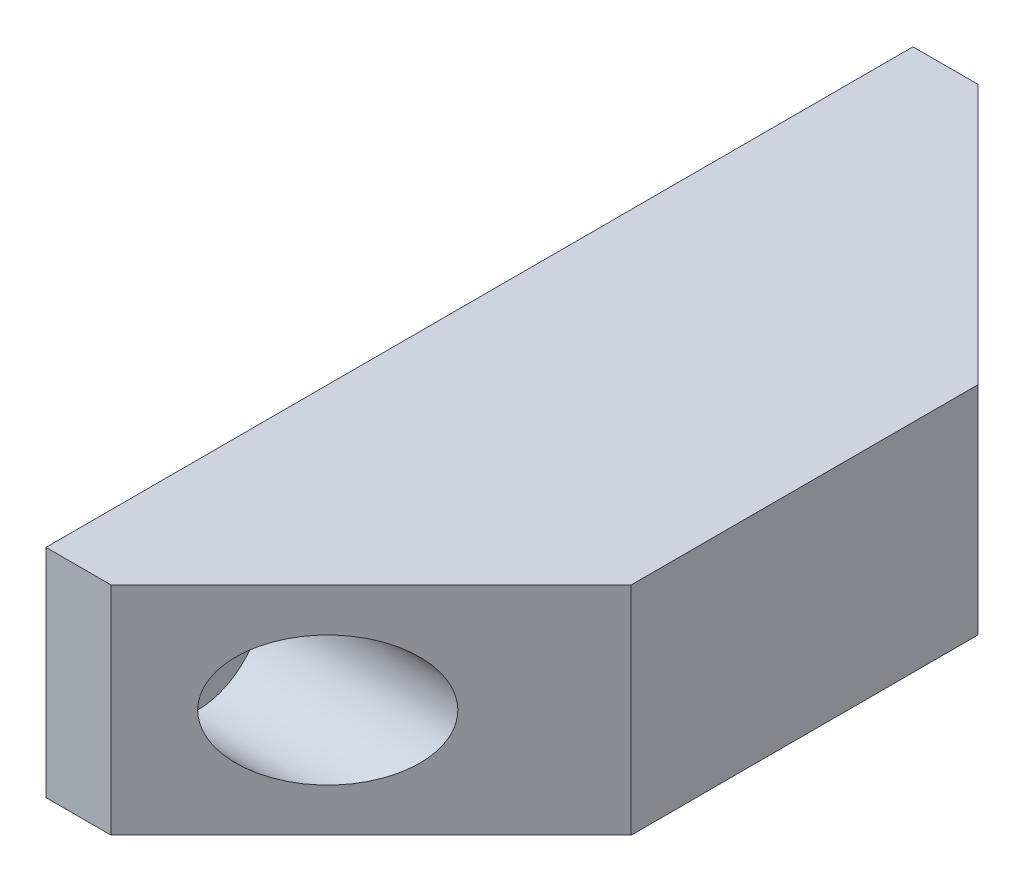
ISO-10303-21;
HEADER;
FILE_DESCRIPTION(('STEP AP214'),'2;1');
FILE_NAME('part.step','',(''),(''),'','','');
FILE_SCHEMA(('AUTOMOTIVE_DESIGN { 1 0 10303 214 1 1 1 1 }'));
ENDSEC;
DATA;
#1=APPLICATION_CONTEXT('core data for automotive mechanical design processes');
#2=APPLICATION_PROTOCOL_DEFINITION('international standard','automotive_design',2000,#1);
#3=PRODUCT_CONTEXT('',#1,'mechanical');
#4=PRODUCT('Part','Part','',(#3));
#5=PRODUCT_RELATED_PRODUCT_CATEGORY('part','',(#4));
#6=PRODUCT_DEFINITION_FORMATION('','',#4);
#7=PRODUCT_DEFINITION_CONTEXT('part definition',#1,'design');
#8=PRODUCT_DEFINITION('design','',#6,#7);
#9=PRODUCT_DEFINITION_SHAPE('','',#8);
#10=(LENGTH_UNIT() NAMED_UNIT(*) SI_UNIT(.MILLI.,.METRE.));
#11=(NAMED_UNIT(*) PLANE_ANGLE_UNIT() SI_UNIT($,.RADIAN.));
#12=(NAMED_UNIT(*) SI_UNIT($,.STERADIAN.) SOLID_ANGLE_UNIT());
#13=UNCERTAINTY_MEASURE_WITH_UNIT(LENGTH_MEASURE(1.E-05),#10,'distance_accuracy_value','');
#14=(GEOMETRIC_REPRESENTATION_CONTEXT(3) GLOBAL_UNCERTAINTY_ASSIGNED_CONTEXT((#13)) GLOBAL_UNIT_ASSIGNED_CONTEXT((#10,
#11,#12)) REPRESENTATION_CONTEXT('',''));
#15=CARTESIAN_POINT('',(0.,0.,0.));
#16=DIRECTION('',(0.,0.,1.));
#17=DIRECTION('',(1.,0.,0.));
#18=AXIS2_PLACEMENT_3D('',#15,#16,#17);
#19=CARTESIAN_POINT('',(1.11022302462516E-13,5.,-19.9999999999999));
#20=DIRECTION('',(1.,0.,0.));
#21=DIRECTION('',(0.,0.,-1.));
#22=AXIS2_PLACEMENT_3D('',#19,#20,#21);
#23=PLANE('',#22);
#24=CARTESIAN_POINT('',(0.,0.,15.0000000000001));
#25=DIRECTION('',(1.,0.,0.));
#26=DIRECTION('',(0.,0.,-1.));
#27=AXIS2_PLACEMENT_3D('',#24,#25,#26);
#28=CIRCLE('',#27,1.55);
#29=CARTESIAN_POINT('',(0.,0.,13.4500000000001));
#30=VERTEX_POINT('',#29);
#31=EDGE_CURVE('E198',#30,#30,#28,.T.);
#32=ORIENTED_EDGE('',*,*,#31,.T.);
#33=EDGE_LOOP('',(#32));
#34=FACE_BOUND('',#33,.T.);
#35=CARTESIAN_POINT('',(1.11022302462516E-13,0.,-15.));
#36=DIRECTION('',(-1.,0.,0.));
#37=DIRECTION('',(0.,0.,1.));
#38=AXIS2_PLACEMENT_3D('',#35,#36,#37);
#39=CIRCLE('',#38,1.55);
#40=CARTESIAN_POINT('',(1.11022302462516E-13,0.,-13.45));
#41=VERTEX_POINT('',#40);
#42=EDGE_CURVE('E156',#41,#41,#39,.T.);
#43=ORIENTED_EDGE('',*,*,#42,.F.);
#44=EDGE_LOOP('',(#43));
#45=FACE_BOUND('',#44,.T.);
#46=DIRECTION('',(0.,0.,1.));
#47=VECTOR('',#46,1.);
#48=CARTESIAN_POINT('',(1.11022302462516E-13,-5.,-20.));
#49=LINE('',#48,#47);
#50=CARTESIAN_POINT('',(1.11022302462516E-13,-5.,-20.));
#51=VERTEX_POINT('',#50);
#52=CARTESIAN_POINT('',(0.,-5.,20.));
#53=VERTEX_POINT('',#52);
#54=EDGE_CURVE('E139',#51,#53,#49,.T.);
#55=ORIENTED_EDGE('',*,*,#54,.T.);
#56=DIRECTION('',(0.,-1.,0.));
#57=VECTOR('',#56,1.);
#58=CARTESIAN_POINT('',(0.,5.,20.));
#59=LINE('',#58,#57);
#60=CARTESIAN_POINT('',(0.,5.,20.));
#61=VERTEX_POINT('',#60);
#62=EDGE_CURVE('E13',#61,#53,#59,.T.);
#63=ORIENTED_EDGE('',*,*,#62,.F.);
#64=DIRECTION('',(0.,0.,1.));
#65=VECTOR('',#64,1.);
#66=CARTESIAN_POINT('',(1.11022302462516E-13,5.,-19.9999999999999));
#67=LINE('',#66,#65);
#68=CARTESIAN_POINT('',(1.11022302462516E-13,5.,-19.9999999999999));
#69=VERTEX_POINT('',#68);
#70=EDGE_CURVE('E150',#69,#61,#67,.T.);
#71=ORIENTED_EDGE('',*,*,#70,.F.);
#72=DIRECTION('',(0.,-1.,0.));
#73=VECTOR('',#72,1.);
#74=CARTESIAN_POINT('',(1.11022302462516E-13,5.,-19.9999999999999));
#75=LINE('',#74,#73);
#76=EDGE_CURVE('E135',#69,#51,#75,.T.);
#77=ORIENTED_EDGE('',*,*,#76,.T.);
#78=EDGE_LOOP('',(#55,#63,#71,#77));
#79=FACE_BOUND('',#78,.T.);
#80=ADVANCED_FACE('F53',(#34,#45,#79),#23,.F.);
#81=CARTESIAN_POINT('',(0.,5.,20.));
#82=DIRECTION('',(0.,0.,-1.));
#83=DIRECTION('',(-1.,0.,0.));
#84=AXIS2_PLACEMENT_3D('',#81,#82,#83);
#85=PLANE('',#84);
#86=DIRECTION('',(1.,0.,0.));
#87=VECTOR('',#86,1.);
#88=CARTESIAN_POINT('',(0.,-5.,20.));
#89=LINE('',#88,#87);
#90=CARTESIAN_POINT('',(3.,-5.,20.));
#91=VERTEX_POINT('',#90);
#92=EDGE_CURVE('E142',#53,#91,#89,.T.);
#93=ORIENTED_EDGE('',*,*,#92,.T.);
#94=DIRECTION('',(0.,-1.,0.));
#95=VECTOR('',#94,1.);
#96=CARTESIAN_POINT('',(3.,5.,20.));
#97=LINE('',#96,#95);
#98=CARTESIAN_POINT('',(3.,5.,20.));
#99=VERTEX_POINT('',#98);
#100=EDGE_CURVE('E62',#99,#91,#97,.T.);
#101=ORIENTED_EDGE('',*,*,#100,.F.);
#102=DIRECTION('',(1.,0.,0.));
#103=VECTOR('',#102,1.);
#104=CARTESIAN_POINT('',(0.,5.,20.));
#105=LINE('',#104,#103);
#106=EDGE_CURVE('E108',#61,#99,#105,.T.);
#107=ORIENTED_EDGE('',*,*,#106,.F.);
#108=ORIENTED_EDGE('',*,*,#62,.T.);
#109=EDGE_LOOP('',(#93,#101,#107,#108));
#110=FACE_BOUND('',#109,.T.);
#111=ADVANCED_FACE('F172',(#110),#85,.F.);
#112=CARTESIAN_POINT('',(15.,5.,8.00000000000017));
#113=DIRECTION('',(-0.707106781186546,0.,-0.707106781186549));
#114=DIRECTION('',(-0.707106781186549,0.,0.707106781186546));
#115=AXIS2_PLACEMENT_3D('',#112,#113,#114);
#116=PLANE('',#115);
#117=CARTESIAN_POINT('',(8.00000000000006,0.,15.));
#118=DIRECTION('',(-0.707106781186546,0.,-0.707106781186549));
#119=DIRECTION('',(-0.707106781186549,0.,0.707106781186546));
#120=AXIS2_PLACEMENT_3D('',#117,#118,#119);
#121=ELLIPSE('',#120,4.24264068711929,3.);
#122=CARTESIAN_POINT('',(5.00000000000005,0.,18.));
#123=VERTEX_POINT('',#122);
#124=EDGE_CURVE('E56',#123,#123,#121,.T.);
#125=ORIENTED_EDGE('',*,*,#124,.T.);
#126=EDGE_LOOP('',(#125));
#127=FACE_BOUND('',#126,.T.);
#128=DIRECTION('',(0.707106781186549,0.,-0.707106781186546));
#129=VECTOR('',#128,1.);
#130=CARTESIAN_POINT('',(15.,-5.,8.00000000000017));
#131=LINE('',#130,#129);
#132=CARTESIAN_POINT('',(15.,-5.,8.00000000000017));
#133=VERTEX_POINT('',#132);
#134=EDGE_CURVE('E145',#91,#133,#131,.T.);
#135=ORIENTED_EDGE('',*,*,#134,.T.);
#136=DIRECTION('',(0.,-1.,0.));
#137=VECTOR('',#136,1.);
#138=CARTESIAN_POINT('',(15.,5.,8.00000000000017));
#139=LINE('',#138,#137);
#140=CARTESIAN_POINT('',(15.,5.,8.00000000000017));
#141=VERTEX_POINT('',#140);
#142=EDGE_CURVE('E130',#141,#133,#139,.T.);
#143=ORIENTED_EDGE('',*,*,#142,.F.);
#144=DIRECTION('',(0.707106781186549,0.,-0.707106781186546));
#145=VECTOR('',#144,1.);
#146=CARTESIAN_POINT('',(15.,5.,8.00000000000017));
#147=LINE('',#146,#145);
#148=EDGE_CURVE('E121',#99,#141,#147,.T.);
#149=ORIENTED_EDGE('',*,*,#148,.F.);
#150=ORIENTED_EDGE('',*,*,#100,.T.);
#151=EDGE_LOOP('',(#135,#143,#149,#150));
#152=FACE_BOUND('',#151,.T.);
#153=ADVANCED_FACE('F175',(#127,#152),#116,.F.);
#154=CARTESIAN_POINT('',(15.,5.,-7.99999999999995));
#155=DIRECTION('',(-1.,0.,0.));
#156=DIRECTION('',(0.,0.,1.));
#157=AXIS2_PLACEMENT_3D('',#154,#155,#156);
#158=PLANE('',#157);
#159=DIRECTION('',(0.,0.,-1.));
#160=VECTOR('',#159,1.);
#161=CARTESIAN_POINT('',(15.,-5.,-7.99999999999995));
#162=LINE('',#161,#160);
#163=CARTESIAN_POINT('',(15.,-5.,-7.99999999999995));
#164=VERTEX_POINT('',#163);
#165=EDGE_CURVE('E129',#133,#164,#162,.T.);
#166=ORIENTED_EDGE('',*,*,#165,.T.);
#167=DIRECTION('',(0.,-1.,0.));
#168=VECTOR('',#167,1.);
#169=CARTESIAN_POINT('',(15.,5.,-7.99999999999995));
#170=LINE('',#169,#168);
#171=CARTESIAN_POINT('',(15.,5.,-7.99999999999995));
#172=VERTEX_POINT('',#171);
#173=EDGE_CURVE('E126',#172,#164,#170,.T.);
#174=ORIENTED_EDGE('',*,*,#173,.F.);
#175=DIRECTION('',(0.,0.,-1.));
#176=VECTOR('',#175,1.);
#177=CARTESIAN_POINT('',(15.,5.,-7.99999999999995));
#178=LINE('',#177,#176);
#179=EDGE_CURVE('E115',#141,#172,#178,.T.);
#180=ORIENTED_EDGE('',*,*,#179,.F.);
#181=ORIENTED_EDGE('',*,*,#142,.T.);
#182=EDGE_LOOP('',(#166,#174,#180,#181));
#183=FACE_BOUND('',#182,.T.);
#184=ADVANCED_FACE('F127',(#183),#158,.F.);
#185=CARTESIAN_POINT('',(3.00000000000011,5.,-19.9999999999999));
#186=DIRECTION('',(-0.707106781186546,0.,0.707106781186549));
#187=DIRECTION('',(0.707106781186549,0.,0.707106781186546));
#188=AXIS2_PLACEMENT_3D('',#185,#186,#187);
#189=PLANE('',#188);
#190=CARTESIAN_POINT('',(8.00000000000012,0.,-14.9999999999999));
#191=DIRECTION('',(-0.707106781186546,0.,0.707106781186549));
#192=DIRECTION('',(-0.707106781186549,0.,-0.707106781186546));
#193=AXIS2_PLACEMENT_3D('',#190,#191,#192);
#194=ELLIPSE('',#193,4.24264068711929,3.);
#195=CARTESIAN_POINT('',(5.00000000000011,0.,-17.9999999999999));
#196=VERTEX_POINT('',#195);
#197=EDGE_CURVE('E143',#196,#196,#194,.T.);
#198=ORIENTED_EDGE('',*,*,#197,.T.);
#199=EDGE_LOOP('',(#198));
#200=FACE_BOUND('',#199,.T.);
#201=DIRECTION('',(-0.707106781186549,0.,-0.707106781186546));
#202=VECTOR('',#201,1.);
#203=CARTESIAN_POINT('',(3.00000000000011,-5.,-20.));
#204=LINE('',#203,#202);
#205=CARTESIAN_POINT('',(3.00000000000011,-5.,-20.));
#206=VERTEX_POINT('',#205);
#207=EDGE_CURVE('E94',#164,#206,#204,.T.);
#208=ORIENTED_EDGE('',*,*,#207,.T.);
#209=DIRECTION('',(0.,-1.,0.));
#210=VECTOR('',#209,1.);
#211=CARTESIAN_POINT('',(3.00000000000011,5.,-19.9999999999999));
#212=LINE('',#211,#210);
#213=CARTESIAN_POINT('',(3.00000000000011,5.,-19.9999999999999));
#214=VERTEX_POINT('',#213);
#215=EDGE_CURVE('E131',#214,#206,#212,.T.);
#216=ORIENTED_EDGE('',*,*,#215,.F.);
#217=DIRECTION('',(-0.707106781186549,0.,-0.707106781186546));
#218=VECTOR('',#217,1.);
#219=CARTESIAN_POINT('',(3.00000000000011,5.,-19.9999999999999));
#220=LINE('',#219,#218);
#221=EDGE_CURVE('E119',#172,#214,#220,.T.);
#222=ORIENTED_EDGE('',*,*,#221,.F.);
#223=ORIENTED_EDGE('',*,*,#173,.T.);
#224=EDGE_LOOP('',(#208,#216,#222,#223));
#225=FACE_BOUND('',#224,.T.);
#226=ADVANCED_FACE('F133',(#200,#225),#189,.F.);
#227=CARTESIAN_POINT('',(1.11022302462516E-13,5.,-19.9999999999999));
#228=DIRECTION('',(0.,0.,1.));
#229=DIRECTION('',(1.,0.,0.));
#230=AXIS2_PLACEMENT_3D('',#227,#228,#229);
#231=PLANE('',#230);
#232=DIRECTION('',(-1.,0.,0.));
#233=VECTOR('',#232,1.);
#234=CARTESIAN_POINT('',(1.11022302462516E-13,-5.,-20.));
#235=LINE('',#234,#233);
#236=EDGE_CURVE('E100',#206,#51,#235,.T.);
#237=ORIENTED_EDGE('',*,*,#236,.T.);
#238=ORIENTED_EDGE('',*,*,#76,.F.);
#239=DIRECTION('',(-1.,0.,0.));
#240=VECTOR('',#239,1.);
#241=CARTESIAN_POINT('',(1.11022302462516E-13,5.,-19.9999999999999));
#242=LINE('',#241,#240);
#243=EDGE_CURVE('E71',#214,#69,#242,.T.);
#244=ORIENTED_EDGE('',*,*,#243,.F.);
#245=ORIENTED_EDGE('',*,*,#215,.T.);
#246=EDGE_LOOP('',(#237,#238,#244,#245));
#247=FACE_BOUND('',#246,.T.);
#248=ADVANCED_FACE('F180',(#247),#231,.F.);
#249=CARTESIAN_POINT('',(0.,5.,1.11022302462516E-13));
#250=DIRECTION('',(0.,1.,0.));
#251=DIRECTION('',(0.,0.,1.));
#252=AXIS2_PLACEMENT_3D('',#249,#250,#251);
#253=PLANE('',#252);
#254=ORIENTED_EDGE('',*,*,#70,.T.);
#255=ORIENTED_EDGE('',*,*,#106,.T.);
#256=ORIENTED_EDGE('',*,*,#148,.T.);
#257=ORIENTED_EDGE('',*,*,#179,.T.);
#258=ORIENTED_EDGE('',*,*,#221,.T.);
#259=ORIENTED_EDGE('',*,*,#243,.T.);
#260=EDGE_LOOP('',(#254,#255,#256,#257,#258,#259));
#261=FACE_BOUND('',#260,.T.);
#262=ADVANCED_FACE('F117',(#261),#253,.T.);
#263=CARTESIAN_POINT('',(0.,-5.,0.));
#264=DIRECTION('',(0.,1.,0.));
#265=DIRECTION('',(0.,0.,1.));
#266=AXIS2_PLACEMENT_3D('',#263,#264,#265);
#267=PLANE('',#266);
#268=ORIENTED_EDGE('',*,*,#54,.F.);
#269=ORIENTED_EDGE('',*,*,#236,.F.);
#270=ORIENTED_EDGE('',*,*,#207,.F.);
#271=ORIENTED_EDGE('',*,*,#165,.F.);
#272=ORIENTED_EDGE('',*,*,#134,.F.);
#273=ORIENTED_EDGE('',*,*,#92,.F.);
#274=EDGE_LOOP('',(#268,#269,#270,#271,#272,#273));
#275=FACE_BOUND('',#274,.T.);
#276=ADVANCED_FACE('F178',(#275),#267,.F.);
#277=CARTESIAN_POINT('',(-9.20923836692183,0.,-15.));
#278=DIRECTION('',(-1.,0.,0.));
#279=DIRECTION('',(0.,0.,1.));
#280=AXIS2_PLACEMENT_3D('',#277,#278,#279);
#281=CYLINDRICAL_SURFACE('',#280,3.);
#282=CARTESIAN_POINT('',(2.00000000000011,0.,-15.));
#283=DIRECTION('',(-1.,0.,0.));
#284=DIRECTION('',(0.,0.,1.));
#285=AXIS2_PLACEMENT_3D('',#282,#283,#284);
#286=CIRCLE('',#285,3.);
#287=CARTESIAN_POINT('',(2.00000000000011,0.,-12.));
#288=VERTEX_POINT('',#287);
#289=EDGE_CURVE('E165',#288,#288,#286,.T.);
#290=ORIENTED_EDGE('',*,*,#289,.T.);
#291=EDGE_LOOP('',(#290));
#292=FACE_BOUND('',#291,.T.);
#293=ORIENTED_EDGE('',*,*,#197,.F.);
#294=EDGE_LOOP('',(#293));
#295=FACE_BOUND('',#294,.T.);
#296=ADVANCED_FACE('F210',(#292,#295),#281,.F.);
#297=CARTESIAN_POINT('',(-9.20923836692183,0.,-15.));
#298=DIRECTION('',(-1.,0.,0.));
#299=DIRECTION('',(0.,0.,1.));
#300=AXIS2_PLACEMENT_3D('',#297,#298,#299);
#301=CYLINDRICAL_SURFACE('',#300,1.55);
#302=CARTESIAN_POINT('',(2.00000000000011,0.,-15.));
#303=DIRECTION('',(-1.,0.,0.));
#304=DIRECTION('',(0.,0.,1.));
#305=AXIS2_PLACEMENT_3D('',#302,#303,#304);
#306=CIRCLE('',#305,1.55);
#307=CARTESIAN_POINT('',(2.00000000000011,0.,-13.45));
#308=VERTEX_POINT('',#307);
#309=EDGE_CURVE('E160',#308,#308,#306,.T.);
#310=ORIENTED_EDGE('',*,*,#309,.F.);
#311=EDGE_LOOP('',(#310));
#312=FACE_BOUND('',#311,.T.);
#313=ORIENTED_EDGE('',*,*,#42,.T.);
#314=EDGE_LOOP('',(#313));
#315=FACE_BOUND('',#314,.T.);
#316=ADVANCED_FACE('F217',(#312,#315),#301,.F.);
#317=CARTESIAN_POINT('',(2.00000000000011,0.,-13.45));
#318=DIRECTION('',(-1.,0.,0.));
#319=DIRECTION('',(0.,0.,1.));
#320=AXIS2_PLACEMENT_3D('',#317,#318,#319);
#321=PLANE('',#320);
#322=ORIENTED_EDGE('',*,*,#289,.F.);
#323=EDGE_LOOP('',(#322));
#324=FACE_BOUND('',#323,.T.);
#325=ORIENTED_EDGE('',*,*,#309,.T.);
#326=EDGE_LOOP('',(#325));
#327=FACE_BOUND('',#326,.T.);
#328=ADVANCED_FACE('F213',(#324,#327),#321,.F.);
#329=CARTESIAN_POINT('',(-9.209238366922,0.,15.0000000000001));
#330=DIRECTION('',(-1.,0.,0.));
#331=DIRECTION('',(0.,0.,-1.));
#332=AXIS2_PLACEMENT_3D('',#329,#330,#331);
#333=CYLINDRICAL_SURFACE('',#332,3.);
#334=CARTESIAN_POINT('',(2.,0.,15.0000000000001));
#335=DIRECTION('',(1.,0.,0.));
#336=DIRECTION('',(0.,0.,-1.));
#337=AXIS2_PLACEMENT_3D('',#334,#335,#336);
#338=CIRCLE('',#337,3.);
#339=CARTESIAN_POINT('',(2.,0.,12.0000000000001));
#340=VERTEX_POINT('',#339);
#341=EDGE_CURVE('E204',#340,#340,#338,.T.);
#342=ORIENTED_EDGE('',*,*,#341,.F.);
#343=EDGE_LOOP('',(#342));
#344=FACE_BOUND('',#343,.T.);
#345=ORIENTED_EDGE('',*,*,#124,.F.);
#346=EDGE_LOOP('',(#345));
#347=FACE_BOUND('',#346,.T.);
#348=ADVANCED_FACE('F216',(#344,#347),#333,.F.);
#349=CARTESIAN_POINT('',(-9.209238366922,0.,15.0000000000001));
#350=DIRECTION('',(-1.,0.,0.));
#351=DIRECTION('',(0.,0.,-1.));
#352=AXIS2_PLACEMENT_3D('',#349,#350,#351);
#353=CYLINDRICAL_SURFACE('',#352,1.55);
#354=CARTESIAN_POINT('',(2.,0.,15.0000000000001));
#355=DIRECTION('',(1.,0.,0.));
#356=DIRECTION('',(0.,0.,-1.));
#357=AXIS2_PLACEMENT_3D('',#354,#355,#356);
#358=CIRCLE('',#357,1.55);
#359=CARTESIAN_POINT('',(2.,0.,13.4500000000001));
#360=VERTEX_POINT('',#359);
#361=EDGE_CURVE('E200',#360,#360,#358,.T.);
#362=ORIENTED_EDGE('',*,*,#361,.T.);
#363=EDGE_LOOP('',(#362));
#364=FACE_BOUND('',#363,.T.);
#365=ORIENTED_EDGE('',*,*,#31,.F.);
#366=EDGE_LOOP('',(#365));
#367=FACE_BOUND('',#366,.T.);
#368=ADVANCED_FACE('F249',(#364,#367),#353,.F.);
#369=CARTESIAN_POINT('',(2.,0.,13.4500000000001));
#370=DIRECTION('',(-1.,0.,0.));
#371=DIRECTION('',(0.,0.,-1.));
#372=AXIS2_PLACEMENT_3D('',#369,#370,#371);
#373=PLANE('',#372);
#374=ORIENTED_EDGE('',*,*,#341,.T.);
#375=EDGE_LOOP('',(#374));
#376=FACE_BOUND('',#375,.T.);
#377=ORIENTED_EDGE('',*,*,#361,.F.);
#378=EDGE_LOOP('',(#377));
#379=FACE_BOUND('',#378,.T.);
#380=ADVANCED_FACE('F257',(#376,#379),#373,.F.);
#381=CLOSED_SHELL('',(#80,#111,#153,#184,#226,#248,#262,#276,#296,#316,#328,#348,#368,#380));
#382=MANIFOLD_SOLID_BREP('B2',#381);
#383=ADVANCED_BREP_SHAPE_REPRESENTATION('',(#18,#382),#14);
#384=SHAPE_DEFINITION_REPRESENTATION(#9,#383);
ENDSEC;
END-ISO-10303-21;
